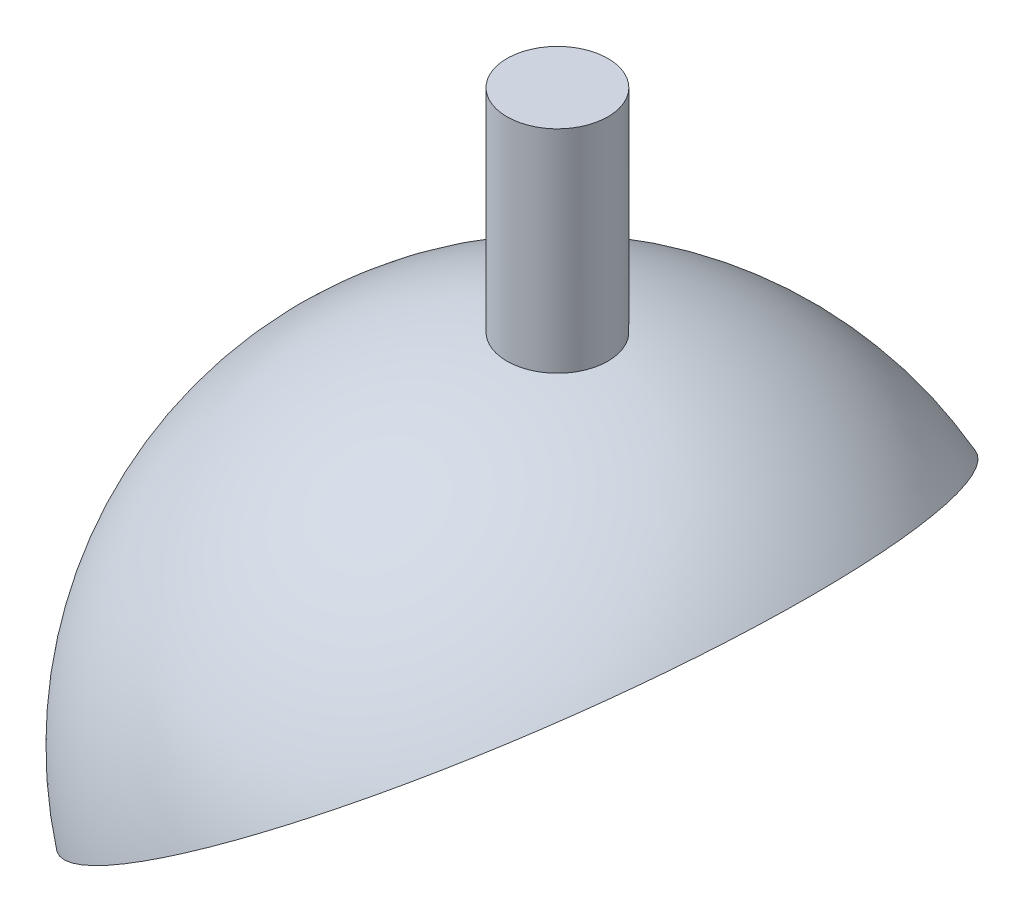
from build123d import *

# Parameters (mm, degrees)
SZKIC4_W = 6.98064687
SZKIC4_H = 29.460585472


with BuildPart() as part:
    # Szkic3 → Obr_t1 (revolve)
    with BuildSketch(Plane.XY):
        with BuildLine():
            Line((35.149486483, 35.56), (29.192067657, 31.572506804))
            Line((29.192067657, 31.572506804), (22.694514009, 41.280021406))
            Line((22.694514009, 41.280021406), (-10.041306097, 41.811148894))
            Line((-10.041306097, 41.811148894), (-23.918014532, 35.734137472))
            Line((-23.918014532, 35.734137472), (-27.811644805, 41.551322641))
            ThreePointArc((-27.811644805, 41.551322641), (4.736556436, 49.775144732), (35.149486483, 35.56))
        make_face()
    revolve(axis=Axis((-27.811644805, 41.551322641, 0), (0.5562328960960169, -0.831026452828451, 0)))

    # Szkic4 → Obr_t2 (revolve)
    with BuildSketch(Plane.XY, mode=Mode.PRIVATE) as obr_t2_sk:
        with Locations((3.490323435, 64.035277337)):
            Rectangle(SZKIC4_W, SZKIC4_H)
    revolve(obr_t2_sk.sketch.rotate(Axis((0, 78.765570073, 0), (0, -1, 0)), 90), axis=Axis((0, 78.765570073, 0), (0, -1, 0)))


solid = part.part
